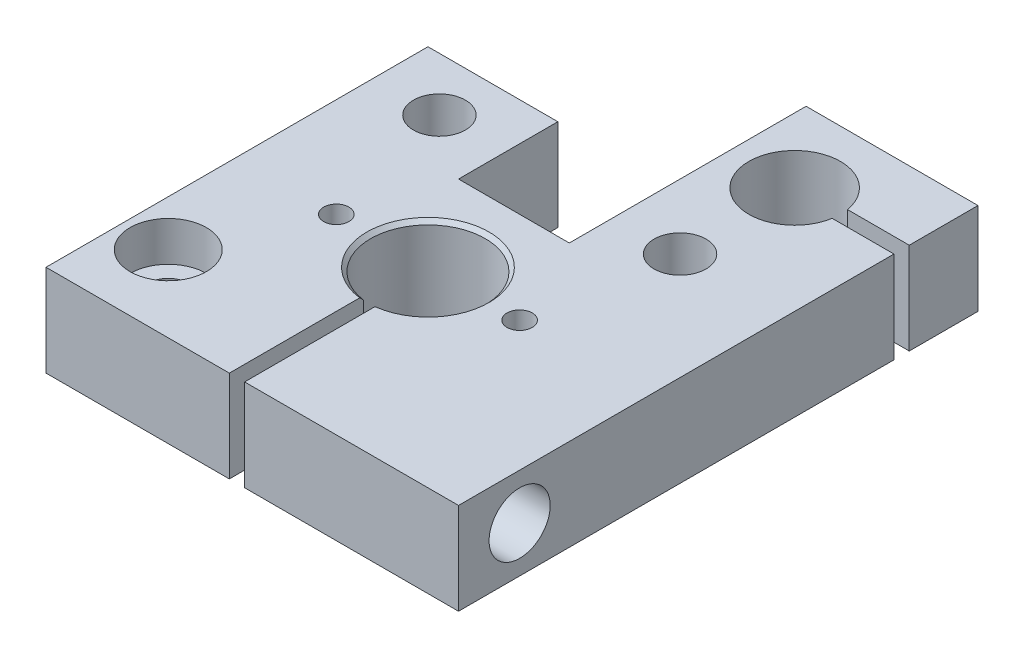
ISO-10303-21;
HEADER;
FILE_DESCRIPTION(('STEP AP214'),'2;1');
FILE_NAME('part.step','',(''),(''),'','','');
FILE_SCHEMA(('AUTOMOTIVE_DESIGN { 1 0 10303 214 1 1 1 1 }'));
ENDSEC;
DATA;
#1=APPLICATION_CONTEXT('core data for automotive mechanical design processes');
#2=APPLICATION_PROTOCOL_DEFINITION('international standard','automotive_design',2000,#1);
#3=PRODUCT_CONTEXT('',#1,'mechanical');
#4=PRODUCT('Part','Part','',(#3));
#5=PRODUCT_RELATED_PRODUCT_CATEGORY('part','',(#4));
#6=PRODUCT_DEFINITION_FORMATION('','',#4);
#7=PRODUCT_DEFINITION_CONTEXT('part definition',#1,'design');
#8=PRODUCT_DEFINITION('design','',#6,#7);
#9=PRODUCT_DEFINITION_SHAPE('','',#8);
#10=(LENGTH_UNIT() NAMED_UNIT(*) SI_UNIT(.MILLI.,.METRE.));
#11=(NAMED_UNIT(*) PLANE_ANGLE_UNIT() SI_UNIT($,.RADIAN.));
#12=(NAMED_UNIT(*) SI_UNIT($,.STERADIAN.) SOLID_ANGLE_UNIT());
#13=UNCERTAINTY_MEASURE_WITH_UNIT(LENGTH_MEASURE(1.E-05),#10,'distance_accuracy_value','');
#14=(GEOMETRIC_REPRESENTATION_CONTEXT(3) GLOBAL_UNCERTAINTY_ASSIGNED_CONTEXT((#13)) GLOBAL_UNIT_ASSIGNED_CONTEXT((#10,
#11,#12)) REPRESENTATION_CONTEXT('',''));
#15=CARTESIAN_POINT('',(0.,0.,0.));
#16=DIRECTION('',(0.,0.,1.));
#17=DIRECTION('',(1.,0.,0.));
#18=AXIS2_PLACEMENT_3D('',#15,#16,#17);
#19=CARTESIAN_POINT('',(54.,12.,0.));
#20=DIRECTION('',(-1.,0.,0.));
#21=DIRECTION('',(0.,0.,1.));
#22=AXIS2_PLACEMENT_3D('',#19,#20,#21);
#23=PLANE('',#22);
#24=DIRECTION('',(0.,0.,-1.));
#25=VECTOR('',#24,1.);
#26=CARTESIAN_POINT('',(54.,0.,0.));
#27=LINE('',#26,#25);
#28=CARTESIAN_POINT('',(54.,0.,0.));
#29=VERTEX_POINT('',#28);
#30=CARTESIAN_POINT('',(54.,0.,-57.));
#31=VERTEX_POINT('',#30);
#32=EDGE_CURVE('E9466',#29,#31,#27,.T.);
#33=ORIENTED_EDGE('',*,*,#32,.T.);
#34=DIRECTION('',(0.,-1.,0.));
#35=VECTOR('',#34,1.);
#36=CARTESIAN_POINT('',(54.,14.,-57.));
#37=LINE('',#36,#35);
#38=CARTESIAN_POINT('',(54.,12.,-57.));
#39=VERTEX_POINT('',#38);
#40=EDGE_CURVE('E9322',#39,#31,#37,.T.);
#41=ORIENTED_EDGE('',*,*,#40,.F.);
#42=DIRECTION('',(0.,0.,-1.));
#43=VECTOR('',#42,1.);
#44=CARTESIAN_POINT('',(54.,12.,0.));
#45=LINE('',#44,#43);
#46=CARTESIAN_POINT('',(54.,12.,0.));
#47=VERTEX_POINT('',#46);
#48=EDGE_CURVE('E9427',#47,#39,#45,.T.);
#49=ORIENTED_EDGE('',*,*,#48,.F.);
#50=DIRECTION('',(0.,-1.,0.));
#51=VECTOR('',#50,1.);
#52=CARTESIAN_POINT('',(54.,12.,0.));
#53=LINE('',#52,#51);
#54=EDGE_CURVE('E9438',#47,#29,#53,.T.);
#55=ORIENTED_EDGE('',*,*,#54,.T.);
#56=EDGE_LOOP('',(#33,#41,#49,#55));
#57=FACE_BOUND('',#56,.T.);
#58=CARTESIAN_POINT('',(54.,6.,-8.));
#59=DIRECTION('',(1.,0.,0.));
#60=DIRECTION('',(0.,0.,-1.));
#61=AXIS2_PLACEMENT_3D('',#58,#59,#60);
#62=CIRCLE('',#61,3.99999999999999);
#63=CARTESIAN_POINT('',(54.,6.,-12.));
#64=VERTEX_POINT('',#63);
#65=EDGE_CURVE('E9583',#64,#64,#62,.T.);
#66=ORIENTED_EDGE('',*,*,#65,.F.);
#67=EDGE_LOOP('',(#66));
#68=FACE_BOUND('',#67,.T.);
#69=ADVANCED_FACE('F9174',(#57,#68),#23,.F.);
#70=CARTESIAN_POINT('',(0.,12.,-68.));
#71=DIRECTION('',(0.,0.,1.));
#72=DIRECTION('',(1.,0.,0.));
#73=AXIS2_PLACEMENT_3D('',#70,#71,#72);
#74=PLANE('',#73);
#75=DIRECTION('',(-1.,0.,0.));
#76=VECTOR('',#75,1.);
#77=CARTESIAN_POINT('',(0.,0.,-68.));
#78=LINE('',#77,#76);
#79=CARTESIAN_POINT('',(54.,0.,-68.));
#80=VERTEX_POINT('',#79);
#81=CARTESIAN_POINT('',(31.5,0.,-68.));
#82=VERTEX_POINT('',#81);
#83=EDGE_CURVE('E9470',#80,#82,#78,.T.);
#84=ORIENTED_EDGE('',*,*,#83,.T.);
#85=DIRECTION('',(0.,1.,0.));
#86=VECTOR('',#85,1.);
#87=CARTESIAN_POINT('',(31.5,0.,-68.));
#88=LINE('',#87,#86);
#89=CARTESIAN_POINT('',(31.5,12.,-68.));
#90=VERTEX_POINT('',#89);
#91=EDGE_CURVE('E9459',#82,#90,#88,.T.);
#92=ORIENTED_EDGE('',*,*,#91,.T.);
#93=DIRECTION('',(-1.,0.,0.));
#94=VECTOR('',#93,1.);
#95=CARTESIAN_POINT('',(0.,12.,-68.));
#96=LINE('',#95,#94);
#97=CARTESIAN_POINT('',(54.,12.,-68.));
#98=VERTEX_POINT('',#97);
#99=EDGE_CURVE('E9431',#98,#90,#96,.T.);
#100=ORIENTED_EDGE('',*,*,#99,.F.);
#101=DIRECTION('',(0.,-1.,0.));
#102=VECTOR('',#101,1.);
#103=CARTESIAN_POINT('',(54.,12.,-68.));
#104=LINE('',#103,#102);
#105=EDGE_CURVE('E9423',#98,#80,#104,.T.);
#106=ORIENTED_EDGE('',*,*,#105,.T.);
#107=EDGE_LOOP('',(#84,#92,#100,#106));
#108=FACE_BOUND('',#107,.T.);
#109=CARTESIAN_POINT('',(49.5,6.,-68.));
#110=DIRECTION('',(0.,0.,-1.));
#111=DIRECTION('',(-1.,0.,0.));
#112=AXIS2_PLACEMENT_3D('',#109,#110,#111);
#113=CIRCLE('',#112,4.);
#114=CARTESIAN_POINT('',(45.5,6.,-68.));
#115=VERTEX_POINT('',#114);
#116=EDGE_CURVE('E9561',#115,#115,#113,.T.);
#117=ORIENTED_EDGE('',*,*,#116,.F.);
#118=EDGE_LOOP('',(#117));
#119=FACE_BOUND('',#118,.T.);
#120=ADVANCED_FACE('F9397',(#108,#119),#74,.F.);
#121=CARTESIAN_POINT('',(54.,12.,-59.));
#122=VERTEX_POINT('',#121);
#123=EDGE_CURVE('E9420',#122,#98,#45,.T.);
#124=ORIENTED_EDGE('',*,*,#123,.F.);
#125=DIRECTION('',(0.,1.,0.));
#126=VECTOR('',#125,1.);
#127=CARTESIAN_POINT('',(54.,14.,-59.));
#128=LINE('',#127,#126);
#129=CARTESIAN_POINT('',(54.,0.,-59.));
#130=VERTEX_POINT('',#129);
#131=EDGE_CURVE('E9326',#130,#122,#128,.T.);
#132=ORIENTED_EDGE('',*,*,#131,.F.);
#133=EDGE_CURVE('E9464',#130,#80,#27,.T.);
#134=ORIENTED_EDGE('',*,*,#133,.T.);
#135=ORIENTED_EDGE('',*,*,#105,.F.);
#136=EDGE_LOOP('',(#124,#132,#134,#135));
#137=FACE_BOUND('',#136,.T.);
#138=ADVANCED_FACE('F9400',(#137),#23,.F.);
#139=CARTESIAN_POINT('',(0.,12.,0.));
#140=DIRECTION('',(0.,0.,-1.));
#141=DIRECTION('',(-1.,0.,0.));
#142=AXIS2_PLACEMENT_3D('',#139,#140,#141);
#143=PLANE('',#142);
#144=DIRECTION('',(1.,0.,0.));
#145=VECTOR('',#144,1.);
#146=CARTESIAN_POINT('',(0.,12.,0.));
#147=LINE('',#146,#145);
#148=CARTESIAN_POINT('',(26.,12.,0.));
#149=VERTEX_POINT('',#148);
#150=EDGE_CURVE('E9433',#149,#47,#147,.T.);
#151=ORIENTED_EDGE('',*,*,#150,.F.);
#152=DIRECTION('',(0.,1.,0.));
#153=VECTOR('',#152,1.);
#154=CARTESIAN_POINT('',(26.,14.,0.));
#155=LINE('',#154,#153);
#156=CARTESIAN_POINT('',(26.,0.,0.));
#157=VERTEX_POINT('',#156);
#158=EDGE_CURVE('E9324',#157,#149,#155,.T.);
#159=ORIENTED_EDGE('',*,*,#158,.F.);
#160=DIRECTION('',(1.,0.,0.));
#161=VECTOR('',#160,1.);
#162=CARTESIAN_POINT('',(0.,0.,0.));
#163=LINE('',#162,#161);
#164=EDGE_CURVE('E9458',#157,#29,#163,.T.);
#165=ORIENTED_EDGE('',*,*,#164,.T.);
#166=ORIENTED_EDGE('',*,*,#54,.F.);
#167=EDGE_LOOP('',(#151,#159,#165,#166));
#168=FACE_BOUND('',#167,.T.);
#169=ADVANCED_FACE('F9410',(#168),#143,.F.);
#170=CARTESIAN_POINT('',(0.,0.,-68.));
#171=DIRECTION('',(0.,-1.,0.));
#172=DIRECTION('',(0.,0.,-1.));
#173=AXIS2_PLACEMENT_3D('',#170,#171,#172);
#174=PLANE('',#173);
#175=CARTESIAN_POINT('',(40.,0.,-58.));
#176=DIRECTION('',(0.,1.,0.));
#177=DIRECTION('',(0.,0.,1.));
#178=AXIS2_PLACEMENT_3D('',#175,#176,#177);
#179=CIRCLE('',#178,6.);
#180=CARTESIAN_POINT('',(45.9160797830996,0.,-59.));
#181=VERTEX_POINT('',#180);
#182=CARTESIAN_POINT('',(45.9160797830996,0.,-57.));
#183=VERTEX_POINT('',#182);
#184=EDGE_CURVE('E9303',#181,#183,#179,.T.);
#185=ORIENTED_EDGE('',*,*,#184,.T.);
#186=DIRECTION('',(-1.,0.,0.));
#187=VECTOR('',#186,1.);
#188=CARTESIAN_POINT('',(0.,0.,-57.));
#189=LINE('',#188,#187);
#190=EDGE_CURVE('E9314',#31,#183,#189,.T.);
#191=ORIENTED_EDGE('',*,*,#190,.F.);
#192=ORIENTED_EDGE('',*,*,#32,.F.);
#193=ORIENTED_EDGE('',*,*,#164,.F.);
#194=DIRECTION('',(0.,0.,1.));
#195=VECTOR('',#194,1.);
#196=CARTESIAN_POINT('',(26.,0.,-68.));
#197=LINE('',#196,#195);
#198=CARTESIAN_POINT('',(26.,0.,-17.0627460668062));
#199=VERTEX_POINT('',#198);
#200=EDGE_CURVE('E9481',#199,#157,#197,.T.);
#201=ORIENTED_EDGE('',*,*,#200,.F.);
#202=CARTESIAN_POINT('',(25.,0.,-25.));
#203=DIRECTION('',(0.,1.,0.));
#204=DIRECTION('',(0.,0.,1.));
#205=AXIS2_PLACEMENT_3D('',#202,#203,#204);
#206=CIRCLE('',#205,8.);
#207=CARTESIAN_POINT('',(24.,0.,-17.0627460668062));
#208=VERTEX_POINT('',#207);
#209=EDGE_CURVE('E9483',#199,#208,#206,.T.);
#210=ORIENTED_EDGE('',*,*,#209,.T.);
#211=DIRECTION('',(0.,0.,-1.));
#212=VECTOR('',#211,1.);
#213=CARTESIAN_POINT('',(24.,0.,-68.));
#214=LINE('',#213,#212);
#215=CARTESIAN_POINT('',(24.,0.,0.));
#216=VERTEX_POINT('',#215);
#217=EDGE_CURVE('E9463',#216,#208,#214,.T.);
#218=ORIENTED_EDGE('',*,*,#217,.F.);
#219=CARTESIAN_POINT('',(0.,0.,0.));
#220=VERTEX_POINT('',#219);
#221=EDGE_CURVE('E9449',#220,#216,#163,.T.);
#222=ORIENTED_EDGE('',*,*,#221,.F.);
#223=DIRECTION('',(0.,0.,1.));
#224=VECTOR('',#223,1.);
#225=CARTESIAN_POINT('',(0.,0.,0.));
#226=LINE('',#225,#224);
#227=CARTESIAN_POINT('',(0.,0.,-50.));
#228=VERTEX_POINT('',#227);
#229=EDGE_CURVE('E9455',#228,#220,#226,.T.);
#230=ORIENTED_EDGE('',*,*,#229,.F.);
#231=DIRECTION('',(1.,0.,0.));
#232=VECTOR('',#231,1.);
#233=CARTESIAN_POINT('',(17.,0.,-50.));
#234=LINE('',#233,#232);
#235=CARTESIAN_POINT('',(17.,0.,-50.));
#236=VERTEX_POINT('',#235);
#237=EDGE_CURVE('E9525',#228,#236,#234,.T.);
#238=ORIENTED_EDGE('',*,*,#237,.T.);
#239=DIRECTION('',(0.,0.,1.));
#240=VECTOR('',#239,1.);
#241=CARTESIAN_POINT('',(17.,0.,-37.));
#242=LINE('',#241,#240);
#243=CARTESIAN_POINT('',(17.,0.,-37.));
#244=VERTEX_POINT('',#243);
#245=EDGE_CURVE('E9527',#236,#244,#242,.T.);
#246=ORIENTED_EDGE('',*,*,#245,.T.);
#247=DIRECTION('',(1.,0.,0.));
#248=VECTOR('',#247,1.);
#249=CARTESIAN_POINT('',(31.5,0.,-37.));
#250=LINE('',#249,#248);
#251=CARTESIAN_POINT('',(31.5,0.,-37.));
#252=VERTEX_POINT('',#251);
#253=EDGE_CURVE('E9530',#244,#252,#250,.T.);
#254=ORIENTED_EDGE('',*,*,#253,.T.);
#255=DIRECTION('',(0.,0.,-1.));
#256=VECTOR('',#255,1.);
#257=CARTESIAN_POINT('',(31.5,0.,-68.));
#258=LINE('',#257,#256);
#259=EDGE_CURVE('E9533',#252,#82,#258,.T.);
#260=ORIENTED_EDGE('',*,*,#259,.T.);
#261=ORIENTED_EDGE('',*,*,#83,.F.);
#262=ORIENTED_EDGE('',*,*,#133,.F.);
#263=DIRECTION('',(1.,0.,0.));
#264=VECTOR('',#263,1.);
#265=CARTESIAN_POINT('',(0.,0.,-59.));
#266=LINE('',#265,#264);
#267=EDGE_CURVE('E9317',#181,#130,#266,.T.);
#268=ORIENTED_EDGE('',*,*,#267,.F.);
#269=EDGE_LOOP('',(#185,#191,#192,#193,#201,#210,#218,#222,#230,#238,#246,#254,#260,#261,#262,#268));
#270=FACE_BOUND('',#269,.T.);
#271=CARTESIAN_POINT('',(37.,0.,-25.));
#272=DIRECTION('',(0.,1.,0.));
#273=DIRECTION('',(0.,0.,1.));
#274=AXIS2_PLACEMENT_3D('',#271,#272,#273);
#275=CIRCLE('',#274,1.65);
#276=CARTESIAN_POINT('',(37.,0.,-23.35));
#277=VERTEX_POINT('',#276);
#278=EDGE_CURVE('E9849',#277,#277,#275,.T.);
#279=ORIENTED_EDGE('',*,*,#278,.T.);
#280=EDGE_LOOP('',(#279));
#281=FACE_BOUND('',#280,.T.);
#282=CARTESIAN_POINT('',(8.5,0.,-43.));
#283=DIRECTION('',(0.,1.,0.));
#284=DIRECTION('',(0.,0.,1.));
#285=AXIS2_PLACEMENT_3D('',#282,#283,#284);
#286=CIRCLE('',#285,3.4);
#287=CARTESIAN_POINT('',(8.5,0.,-39.6));
#288=VERTEX_POINT('',#287);
#289=EDGE_CURVE('E9508',#288,#288,#286,.T.);
#290=ORIENTED_EDGE('',*,*,#289,.T.);
#291=EDGE_LOOP('',(#290));
#292=FACE_BOUND('',#291,.T.);
#293=CARTESIAN_POINT('',(40.,0.,-43.));
#294=DIRECTION('',(0.,1.,0.));
#295=DIRECTION('',(0.,0.,1.));
#296=AXIS2_PLACEMENT_3D('',#293,#294,#295);
#297=CIRCLE('',#296,3.4);
#298=CARTESIAN_POINT('',(40.,0.,-39.6));
#299=VERTEX_POINT('',#298);
#300=EDGE_CURVE('E9502',#299,#299,#297,.T.);
#301=ORIENTED_EDGE('',*,*,#300,.T.);
#302=EDGE_LOOP('',(#301));
#303=FACE_BOUND('',#302,.T.);
#304=CARTESIAN_POINT('',(13.,0.,-25.));
#305=DIRECTION('',(0.,1.,0.));
#306=DIRECTION('',(0.,0.,1.));
#307=AXIS2_PLACEMENT_3D('',#304,#305,#306);
#308=CIRCLE('',#307,1.65);
#309=CARTESIAN_POINT('',(13.,0.,-23.35));
#310=VERTEX_POINT('',#309);
#311=EDGE_CURVE('E9493',#310,#310,#308,.T.);
#312=ORIENTED_EDGE('',*,*,#311,.T.);
#313=EDGE_LOOP('',(#312));
#314=FACE_BOUND('',#313,.T.);
#315=CARTESIAN_POINT('',(6.,0.,-10.));
#316=DIRECTION('',(0.,1.,0.));
#317=DIRECTION('',(0.,0.,1.));
#318=AXIS2_PLACEMENT_3D('',#315,#316,#317);
#319=CIRCLE('',#318,2.75);
#320=CARTESIAN_POINT('',(6.,0.,-7.25));
#321=VERTEX_POINT('',#320);
#322=EDGE_CURVE('E9484',#321,#321,#319,.T.);
#323=ORIENTED_EDGE('',*,*,#322,.T.);
#324=EDGE_LOOP('',(#323));
#325=FACE_BOUND('',#324,.T.);
#326=ADVANCED_FACE('F9311',(#270,#281,#292,#303,#314,#325),#174,.T.);
#327=CARTESIAN_POINT('',(0.,12.,0.));
#328=DIRECTION('',(1.,0.,0.));
#329=DIRECTION('',(0.,0.,-1.));
#330=AXIS2_PLACEMENT_3D('',#327,#328,#329);
#331=PLANE('',#330);
#332=DIRECTION('',(0.,0.,1.));
#333=VECTOR('',#332,1.);
#334=CARTESIAN_POINT('',(0.,12.,0.));
#335=LINE('',#334,#333);
#336=CARTESIAN_POINT('',(0.,12.,-50.));
#337=VERTEX_POINT('',#336);
#338=CARTESIAN_POINT('',(0.,12.,0.));
#339=VERTEX_POINT('',#338);
#340=EDGE_CURVE('E9453',#337,#339,#335,.T.);
#341=ORIENTED_EDGE('',*,*,#340,.F.);
#342=DIRECTION('',(0.,1.,0.));
#343=VECTOR('',#342,1.);
#344=CARTESIAN_POINT('',(0.,0.,-50.));
#345=LINE('',#344,#343);
#346=EDGE_CURVE('E9456',#228,#337,#345,.T.);
#347=ORIENTED_EDGE('',*,*,#346,.F.);
#348=ORIENTED_EDGE('',*,*,#229,.T.);
#349=DIRECTION('',(0.,-1.,0.));
#350=VECTOR('',#349,1.);
#351=CARTESIAN_POINT('',(0.,12.,0.));
#352=LINE('',#351,#350);
#353=EDGE_CURVE('E9373',#339,#220,#352,.T.);
#354=ORIENTED_EDGE('',*,*,#353,.F.);
#355=EDGE_LOOP('',(#341,#347,#348,#354));
#356=FACE_BOUND('',#355,.T.);
#357=ADVANCED_FACE('F9176',(#356),#331,.F.);
#358=ORIENTED_EDGE('',*,*,#221,.T.);
#359=DIRECTION('',(0.,-1.,0.));
#360=VECTOR('',#359,1.);
#361=CARTESIAN_POINT('',(24.,14.,0.));
#362=LINE('',#361,#360);
#363=CARTESIAN_POINT('',(24.,12.,0.));
#364=VERTEX_POINT('',#363);
#365=EDGE_CURVE('E9331',#364,#216,#362,.T.);
#366=ORIENTED_EDGE('',*,*,#365,.F.);
#367=EDGE_CURVE('E9428',#339,#364,#147,.T.);
#368=ORIENTED_EDGE('',*,*,#367,.F.);
#369=ORIENTED_EDGE('',*,*,#353,.T.);
#370=EDGE_LOOP('',(#358,#366,#368,#369));
#371=FACE_BOUND('',#370,.T.);
#372=ADVANCED_FACE('F9416',(#371),#143,.F.);
#373=CARTESIAN_POINT('',(0.,12.,-68.));
#374=DIRECTION('',(0.,-1.,0.));
#375=DIRECTION('',(0.,0.,-1.));
#376=AXIS2_PLACEMENT_3D('',#373,#374,#375);
#377=PLANE('',#376);
#378=CARTESIAN_POINT('',(6.,12.,-10.));
#379=DIRECTION('',(0.,1.,0.));
#380=DIRECTION('',(0.,0.,1.));
#381=AXIS2_PLACEMENT_3D('',#378,#379,#380);
#382=CIRCLE('',#381,4.99999999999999);
#383=CARTESIAN_POINT('',(6.,12.,-5.00000000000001));
#384=VERTEX_POINT('',#383);
#385=EDGE_CURVE('E9848',#384,#384,#382,.T.);
#386=ORIENTED_EDGE('',*,*,#385,.F.);
#387=EDGE_LOOP('',(#386));
#388=FACE_BOUND('',#387,.T.);
#389=CARTESIAN_POINT('',(37.,12.,-25.));
#390=DIRECTION('',(0.,1.,0.));
#391=DIRECTION('',(0.,0.,1.));
#392=AXIS2_PLACEMENT_3D('',#389,#390,#391);
#393=CIRCLE('',#392,1.64999999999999);
#394=CARTESIAN_POINT('',(37.,12.,-23.35));
#395=VERTEX_POINT('',#394);
#396=EDGE_CURVE('E9852',#395,#395,#393,.T.);
#397=ORIENTED_EDGE('',*,*,#396,.F.);
#398=EDGE_LOOP('',(#397));
#399=FACE_BOUND('',#398,.T.);
#400=CARTESIAN_POINT('',(13.,12.,-25.));
#401=DIRECTION('',(0.,1.,0.));
#402=DIRECTION('',(0.,0.,1.));
#403=AXIS2_PLACEMENT_3D('',#400,#401,#402);
#404=CIRCLE('',#403,1.65);
#405=CARTESIAN_POINT('',(13.,12.,-23.35));
#406=VERTEX_POINT('',#405);
#407=EDGE_CURVE('E9488',#406,#406,#404,.T.);
#408=ORIENTED_EDGE('',*,*,#407,.F.);
#409=EDGE_LOOP('',(#408));
#410=FACE_BOUND('',#409,.T.);
#411=CARTESIAN_POINT('',(40.,12.,-43.));
#412=DIRECTION('',(0.,1.,0.));
#413=DIRECTION('',(0.,0.,1.));
#414=AXIS2_PLACEMENT_3D('',#411,#412,#413);
#415=CIRCLE('',#414,3.39999999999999);
#416=CARTESIAN_POINT('',(40.,12.,-39.6));
#417=VERTEX_POINT('',#416);
#418=EDGE_CURVE('E9505',#417,#417,#415,.T.);
#419=ORIENTED_EDGE('',*,*,#418,.F.);
#420=EDGE_LOOP('',(#419));
#421=FACE_BOUND('',#420,.T.);
#422=CARTESIAN_POINT('',(8.5,12.,-43.));
#423=DIRECTION('',(0.,1.,0.));
#424=DIRECTION('',(0.,0.,1.));
#425=AXIS2_PLACEMENT_3D('',#422,#423,#424);
#426=CIRCLE('',#425,3.4);
#427=CARTESIAN_POINT('',(8.5,12.,-39.6));
#428=VERTEX_POINT('',#427);
#429=EDGE_CURVE('E9511',#428,#428,#426,.T.);
#430=ORIENTED_EDGE('',*,*,#429,.F.);
#431=EDGE_LOOP('',(#430));
#432=FACE_BOUND('',#431,.T.);
#433=DIRECTION('',(-1.,0.,0.));
#434=VECTOR('',#433,1.);
#435=CARTESIAN_POINT('',(0.,12.,-57.));
#436=LINE('',#435,#434);
#437=CARTESIAN_POINT('',(45.9160797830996,12.,-57.));
#438=VERTEX_POINT('',#437);
#439=EDGE_CURVE('E9909',#39,#438,#436,.T.);
#440=ORIENTED_EDGE('',*,*,#439,.T.);
#441=CARTESIAN_POINT('',(40.,12.,-58.));
#442=DIRECTION('',(0.,1.,0.));
#443=DIRECTION('',(0.,0.,1.));
#444=AXIS2_PLACEMENT_3D('',#441,#442,#443);
#445=CIRCLE('',#444,5.99999999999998);
#446=CARTESIAN_POINT('',(45.9160797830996,12.,-59.));
#447=VERTEX_POINT('',#446);
#448=EDGE_CURVE('E9189',#447,#438,#445,.T.);
#449=ORIENTED_EDGE('',*,*,#448,.F.);
#450=DIRECTION('',(1.,0.,0.));
#451=VECTOR('',#450,1.);
#452=CARTESIAN_POINT('',(0.,12.,-59.));
#453=LINE('',#452,#451);
#454=EDGE_CURVE('E9182',#447,#122,#453,.T.);
#455=ORIENTED_EDGE('',*,*,#454,.T.);
#456=ORIENTED_EDGE('',*,*,#123,.T.);
#457=ORIENTED_EDGE('',*,*,#99,.T.);
#458=DIRECTION('',(0.,0.,-1.));
#459=VECTOR('',#458,1.);
#460=CARTESIAN_POINT('',(31.5,12.,-68.));
#461=LINE('',#460,#459);
#462=CARTESIAN_POINT('',(31.5,12.,-37.));
#463=VERTEX_POINT('',#462);
#464=EDGE_CURVE('E9523',#463,#90,#461,.T.);
#465=ORIENTED_EDGE('',*,*,#464,.F.);
#466=DIRECTION('',(1.,0.,0.));
#467=VECTOR('',#466,1.);
#468=CARTESIAN_POINT('',(31.5,12.,-37.));
#469=LINE('',#468,#467);
#470=CARTESIAN_POINT('',(17.,12.,-37.));
#471=VERTEX_POINT('',#470);
#472=EDGE_CURVE('E9520',#471,#463,#469,.T.);
#473=ORIENTED_EDGE('',*,*,#472,.F.);
#474=DIRECTION('',(0.,0.,1.));
#475=VECTOR('',#474,1.);
#476=CARTESIAN_POINT('',(17.,12.,-37.));
#477=LINE('',#476,#475);
#478=CARTESIAN_POINT('',(17.,12.,-50.));
#479=VERTEX_POINT('',#478);
#480=EDGE_CURVE('E9517',#479,#471,#477,.T.);
#481=ORIENTED_EDGE('',*,*,#480,.F.);
#482=DIRECTION('',(1.,0.,0.));
#483=VECTOR('',#482,1.);
#484=CARTESIAN_POINT('',(17.,12.,-50.));
#485=LINE('',#484,#483);
#486=EDGE_CURVE('E9514',#337,#479,#485,.T.);
#487=ORIENTED_EDGE('',*,*,#486,.F.);
#488=ORIENTED_EDGE('',*,*,#340,.T.);
#489=ORIENTED_EDGE('',*,*,#367,.T.);
#490=DIRECTION('',(0.,0.,-1.));
#491=VECTOR('',#490,1.);
#492=CARTESIAN_POINT('',(24.,12.,-68.));
#493=LINE('',#492,#491);
#494=CARTESIAN_POINT('',(24.,12.,-17.0627460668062));
#495=VERTEX_POINT('',#494);
#496=EDGE_CURVE('E9344',#364,#495,#493,.T.);
#497=ORIENTED_EDGE('',*,*,#496,.T.);
#498=CARTESIAN_POINT('',(25.,12.,-25.));
#499=DIRECTION('',(0.,1.,0.));
#500=DIRECTION('',(0.,0.,1.));
#501=AXIS2_PLACEMENT_3D('',#498,#499,#500);
#502=CIRCLE('',#501,8.);
#503=CARTESIAN_POINT('',(26.,12.,-17.0627460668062));
#504=VERTEX_POINT('',#503);
#505=EDGE_CURVE('E9499',#504,#495,#502,.T.);
#506=ORIENTED_EDGE('',*,*,#505,.F.);
#507=DIRECTION('',(0.,0.,1.));
#508=VECTOR('',#507,1.);
#509=CARTESIAN_POINT('',(26.,12.,-68.));
#510=LINE('',#509,#508);
#511=EDGE_CURVE('E9477',#504,#149,#510,.T.);
#512=ORIENTED_EDGE('',*,*,#511,.T.);
#513=ORIENTED_EDGE('',*,*,#150,.T.);
#514=ORIENTED_EDGE('',*,*,#48,.T.);
#515=EDGE_LOOP('',(#440,#449,#455,#456,#457,#465,#473,#481,#487,#488,#489,#497,#506,#512,#513,#514));
#516=FACE_BOUND('',#515,.T.);
#517=ADVANCED_FACE('F9475',(#388,#399,#410,#421,#432,#516),#377,.F.);
#518=CARTESIAN_POINT('',(31.5,0.,-68.));
#519=DIRECTION('',(1.,0.,0.));
#520=DIRECTION('',(0.,0.,-1.));
#521=AXIS2_PLACEMENT_3D('',#518,#519,#520);
#522=PLANE('',#521);
#523=ORIENTED_EDGE('',*,*,#464,.T.);
#524=ORIENTED_EDGE('',*,*,#91,.F.);
#525=ORIENTED_EDGE('',*,*,#259,.F.);
#526=DIRECTION('',(0.,1.,0.));
#527=VECTOR('',#526,1.);
#528=CARTESIAN_POINT('',(31.5,0.,-37.));
#529=LINE('',#528,#527);
#530=EDGE_CURVE('E9538',#252,#463,#529,.T.);
#531=ORIENTED_EDGE('',*,*,#530,.T.);
#532=EDGE_LOOP('',(#523,#524,#525,#531));
#533=FACE_BOUND('',#532,.T.);
#534=ADVANCED_FACE('F9557',(#533),#522,.F.);
#535=CARTESIAN_POINT('',(31.5,0.,-37.));
#536=DIRECTION('',(0.,0.,1.));
#537=DIRECTION('',(1.,0.,0.));
#538=AXIS2_PLACEMENT_3D('',#535,#536,#537);
#539=PLANE('',#538);
#540=ORIENTED_EDGE('',*,*,#472,.T.);
#541=ORIENTED_EDGE('',*,*,#530,.F.);
#542=ORIENTED_EDGE('',*,*,#253,.F.);
#543=DIRECTION('',(0.,1.,0.));
#544=VECTOR('',#543,1.);
#545=CARTESIAN_POINT('',(17.,0.,-37.));
#546=LINE('',#545,#544);
#547=EDGE_CURVE('E9540',#244,#471,#546,.T.);
#548=ORIENTED_EDGE('',*,*,#547,.T.);
#549=EDGE_LOOP('',(#540,#541,#542,#548));
#550=FACE_BOUND('',#549,.T.);
#551=ADVANCED_FACE('F9555',(#550),#539,.F.);
#552=CARTESIAN_POINT('',(17.,0.,-37.));
#553=DIRECTION('',(-1.,0.,0.));
#554=DIRECTION('',(0.,0.,1.));
#555=AXIS2_PLACEMENT_3D('',#552,#553,#554);
#556=PLANE('',#555);
#557=ORIENTED_EDGE('',*,*,#480,.T.);
#558=ORIENTED_EDGE('',*,*,#547,.F.);
#559=ORIENTED_EDGE('',*,*,#245,.F.);
#560=DIRECTION('',(0.,1.,0.));
#561=VECTOR('',#560,1.);
#562=CARTESIAN_POINT('',(17.,0.,-50.));
#563=LINE('',#562,#561);
#564=EDGE_CURVE('E9542',#236,#479,#563,.T.);
#565=ORIENTED_EDGE('',*,*,#564,.T.);
#566=EDGE_LOOP('',(#557,#558,#559,#565));
#567=FACE_BOUND('',#566,.T.);
#568=ADVANCED_FACE('F9550',(#567),#556,.F.);
#569=CARTESIAN_POINT('',(17.,0.,-50.));
#570=DIRECTION('',(0.,0.,1.));
#571=DIRECTION('',(1.,0.,0.));
#572=AXIS2_PLACEMENT_3D('',#569,#570,#571);
#573=PLANE('',#572);
#574=ORIENTED_EDGE('',*,*,#486,.T.);
#575=ORIENTED_EDGE('',*,*,#564,.F.);
#576=ORIENTED_EDGE('',*,*,#237,.F.);
#577=ORIENTED_EDGE('',*,*,#346,.T.);
#578=EDGE_LOOP('',(#574,#575,#576,#577));
#579=FACE_BOUND('',#578,.T.);
#580=ADVANCED_FACE('F9544',(#579),#573,.F.);
#581=CARTESIAN_POINT('',(8.5,12.,-43.));
#582=DIRECTION('',(0.,1.,0.));
#583=DIRECTION('',(0.,0.,1.));
#584=AXIS2_PLACEMENT_3D('',#581,#582,#583);
#585=CYLINDRICAL_SURFACE('',#584,3.4);
#586=ORIENTED_EDGE('',*,*,#289,.F.);
#587=EDGE_LOOP('',(#586));
#588=FACE_BOUND('',#587,.T.);
#589=ORIENTED_EDGE('',*,*,#429,.T.);
#590=EDGE_LOOP('',(#589));
#591=FACE_BOUND('',#590,.T.);
#592=ADVANCED_FACE('F9769',(#588,#591),#585,.F.);
#593=CARTESIAN_POINT('',(40.,12.,-43.));
#594=DIRECTION('',(0.,1.,0.));
#595=DIRECTION('',(0.,0.,1.));
#596=AXIS2_PLACEMENT_3D('',#593,#594,#595);
#597=CYLINDRICAL_SURFACE('',#596,3.39999999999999);
#598=ORIENTED_EDGE('',*,*,#300,.F.);
#599=EDGE_LOOP('',(#598));
#600=FACE_BOUND('',#599,.T.);
#601=ORIENTED_EDGE('',*,*,#418,.T.);
#602=EDGE_LOOP('',(#601));
#603=FACE_BOUND('',#602,.T.);
#604=ADVANCED_FACE('F9393',(#600,#603),#597,.F.);
#605=CARTESIAN_POINT('',(25.,12.,-25.));
#606=DIRECTION('',(0.,1.,0.));
#607=DIRECTION('',(0.,0.,1.));
#608=AXIS2_PLACEMENT_3D('',#605,#606,#607);
#609=CONICAL_SURFACE('',#608,8.,0.785398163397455);
#610=CARTESIAN_POINT('',(25.,11.5,-25.));
#611=DIRECTION('',(0.,1.,0.));
#612=DIRECTION('',(0.,0.,1.));
#613=AXIS2_PLACEMENT_3D('',#610,#611,#612);
#614=CIRCLE('',#613,7.5);
#615=CARTESIAN_POINT('',(26.,11.5,-17.5669656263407));
#616=VERTEX_POINT('',#615);
#617=CARTESIAN_POINT('',(24.,11.5,-17.5669656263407));
#618=VERTEX_POINT('',#617);
#619=EDGE_CURVE('E9490',#616,#618,#614,.T.);
#620=ORIENTED_EDGE('',*,*,#619,.F.);
#621=CARTESIAN_POINT('',(26.,5.43966562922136,-23.9643180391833));
#622=CARTESIAN_POINT('',(26.,5.48094615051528,-23.9070109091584));
#623=CARTESIAN_POINT('',(26.,5.52323100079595,-23.850448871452));
#624=CARTESIAN_POINT('',(26.,5.60934117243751,-23.738533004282));
#625=CARTESIAN_POINT('',(26.,5.65316603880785,-23.6831788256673));
#626=CARTESIAN_POINT('',(26.,5.74187952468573,-23.5734046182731));
#627=CARTESIAN_POINT('',(26.,5.78676732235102,-23.5189839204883));
#628=CARTESIAN_POINT('',(26.,5.87738179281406,-23.4108387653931));
#629=CARTESIAN_POINT('',(26.,5.92310853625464,-23.3571143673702));
#630=CARTESIAN_POINT('',(26.,6.06115568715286,-23.1968565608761));
#631=CARTESIAN_POINT('',(26.,6.15442348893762,-23.0911405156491));
#632=CARTESIAN_POINT('',(26.,6.34255651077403,-22.8811021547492));
#633=CARTESIAN_POINT('',(26.,6.43742211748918,-22.7767801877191));
#634=CARTESIAN_POINT('',(26.,6.63130005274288,-22.565758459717));
#635=CARTESIAN_POINT('',(26.,6.7303473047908,-22.4590908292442));
#636=CARTESIAN_POINT('',(26.,6.92923167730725,-22.2464937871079));
#637=CARTESIAN_POINT('',(26.,7.02906880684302,-22.1405643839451));
#638=CARTESIAN_POINT('',(26.,7.32942927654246,-21.8235684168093));
#639=CARTESIAN_POINT('',(26.,7.5307953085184,-21.6133009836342));
#640=CARTESIAN_POINT('',(26.,7.93479238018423,-21.19399441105));
#641=CARTESIAN_POINT('',(26.,8.13742340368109,-20.9849552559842));
#642=CARTESIAN_POINT('',(26.,8.54348715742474,-20.5676659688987));
#643=CARTESIAN_POINT('',(26.,8.74691987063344,-20.3594158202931));
#644=CARTESIAN_POINT('',(26.,9.15461101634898,-19.9431456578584));
#645=CARTESIAN_POINT('',(26.,9.35887021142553,-19.7351263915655));
#646=CARTESIAN_POINT('',(26.,9.76776852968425,-19.3194595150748));
#647=CARTESIAN_POINT('',(26.,9.97240765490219,-19.1118119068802));
#648=CARTESIAN_POINT('',(26.,10.5867192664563,-18.4892830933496));
#649=CARTESIAN_POINT('',(26.,10.9967983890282,-18.0748032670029));
#650=CARTESIAN_POINT('',(26.,11.9166996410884,-17.1464082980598));
#651=CARTESIAN_POINT('',(26.,12.426688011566,-16.6326580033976));
#652=CARTESIAN_POINT('',(26.,13.4472112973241,-15.6056901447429));
#653=CARTESIAN_POINT('',(26.,13.9577462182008,-15.0924725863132));
#654=CARTESIAN_POINT('',(26.,14.9781260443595,-14.0674039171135));
#655=CARTESIAN_POINT('',(26.,15.4879702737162,-13.5555521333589));
#656=CARTESIAN_POINT('',(26.,16.5078849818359,-12.5320855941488));
#657=CARTESIAN_POINT('',(26.,17.0179554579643,-12.0204708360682));
#658=CARTESIAN_POINT('',(26.,17.5280903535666,-11.5089204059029));
#659=B_SPLINE_CURVE_WITH_KNOTS('',3,(#621,#622,#623,#624,#625,#626,#627,#628,#629,#630,#631,
#632,#633,#634,#635,#636,#637,#638,#639,#640,#641,#642,#643,#644,#645,#646,#647,#648,#649,#650,
#651,#652,#653,#654,#655,#656,#657,#658),.UNSPECIFIED.,.F.,.F.,(4,2,2,2,2,2,2,2,2,2,2,2,2,2,2,2,
2,2,4),(0.,0.21184514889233,0.423628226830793,0.635252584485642,0.846894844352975,
1.26979900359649,1.69280701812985,2.12948741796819,2.56617283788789,3.43957186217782,
4.31295972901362,5.18632913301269,6.06093960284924,6.93555477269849,8.68473200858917,
10.8564237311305,13.0281379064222,15.1954865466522,17.3628105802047),.UNSPECIFIED.);
#660=EDGE_CURVE('E9878',#616,#504,#659,.T.);
#661=ORIENTED_EDGE('',*,*,#660,.T.);
#662=ORIENTED_EDGE('',*,*,#505,.T.);
#663=CARTESIAN_POINT('',(24.,17.5280903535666,-11.5089204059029));
#664=CARTESIAN_POINT('',(24.,17.017383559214,-12.0210432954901));
#665=CARTESIAN_POINT('',(24.,16.5067421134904,-12.5332314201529));
#666=CARTESIAN_POINT('',(24.,15.4857208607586,-13.5578104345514));
#667=CARTESIAN_POINT('',(24.,14.9753410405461,-14.0702013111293));
#668=CARTESIAN_POINT('',(24.,13.9549956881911,-15.0952361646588));
#669=CARTESIAN_POINT('',(24.,13.4450301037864,-15.6078800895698));
#670=CARTESIAN_POINT('',(24.,12.6804787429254,-16.3772671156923));
#671=CARTESIAN_POINT('',(24.,12.4256878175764,-16.6338063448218));
#672=CARTESIAN_POINT('',(24.,11.9162856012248,-17.1470662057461));
#673=CARTESIAN_POINT('',(24.,11.6616743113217,-17.4037868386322));
#674=CARTESIAN_POINT('',(24.,11.1526131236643,-17.917551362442));
#675=CARTESIAN_POINT('',(24.,10.8981633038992,-18.1745953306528));
#676=CARTESIAN_POINT('',(24.,10.3896066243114,-18.6890113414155));
#677=CARTESIAN_POINT('',(24.,10.1354997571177,-18.9463833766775));
#678=CARTESIAN_POINT('',(24.,9.62781785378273,-19.4615658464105));
#679=CARTESIAN_POINT('',(24.,9.37424273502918,-19.7193761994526));
#680=CARTESIAN_POINT('',(24.,8.86781054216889,-20.235741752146));
#681=CARTESIAN_POINT('',(24.,8.61495352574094,-20.4942970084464));
#682=CARTESIAN_POINT('',(24.,8.2365091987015,-20.8830985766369));
#683=CARTESIAN_POINT('',(24.,8.11046408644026,-21.0128991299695));
#684=CARTESIAN_POINT('',(24.,7.85878744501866,-21.2728951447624));
#685=CARTESIAN_POINT('',(24.,7.73315590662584,-21.4030905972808));
#686=CARTESIAN_POINT('',(24.,7.48248297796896,-21.6639847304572));
#687=CARTESIAN_POINT('',(24.,7.35744144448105,-21.7946832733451));
#688=CARTESIAN_POINT('',(24.,7.10813858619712,-22.0568433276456));
#689=CARTESIAN_POINT('',(24.,6.9838773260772,-22.1883049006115));
#690=CARTESIAN_POINT('',(24.,6.73640255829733,-22.4524412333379));
#691=CARTESIAN_POINT('',(24.,6.61319011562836,-22.5851169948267));
#692=CARTESIAN_POINT('',(24.,6.42977436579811,-22.7853870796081));
#693=CARTESIAN_POINT('',(24.,6.36887679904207,-22.8523451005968));
#694=CARTESIAN_POINT('',(24.,6.2476837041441,-22.9868099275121));
#695=CARTESIAN_POINT('',(24.,6.18738820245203,-23.0543167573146));
#696=CARTESIAN_POINT('',(24.,6.0675327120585,-23.1901071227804));
#697=CARTESIAN_POINT('',(24.,6.00797355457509,-23.2583913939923));
#698=CARTESIAN_POINT('',(24.,5.88995320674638,-23.3958899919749));
#699=CARTESIAN_POINT('',(24.,5.83149188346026,-23.4651042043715));
#700=CARTESIAN_POINT('',(24.,5.7160544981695,-23.6048641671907));
#701=CARTESIAN_POINT('',(24.,5.65907967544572,-23.6754109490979));
#702=CARTESIAN_POINT('',(24.,5.57531303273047,-23.7825824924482));
#703=CARTESIAN_POINT('',(24.,5.54766789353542,-23.8185391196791));
#704=CARTESIAN_POINT('',(24.,5.49309242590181,-23.8909973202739));
#705=CARTESIAN_POINT('',(24.,5.46616218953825,-23.9274989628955));
#706=CARTESIAN_POINT('',(24.,5.43966562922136,-23.9643180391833));
#707=B_SPLINE_CURVE_WITH_KNOTS('',3,(#663,#664,#665,#666,#667,#668,#669,#670,#671,#672,#673,
#674,#675,#676,#677,#678,#679,#680,#681,#682,#683,#684,#685,#686,#687,#688,#689,#690,#691,#692,
#693,#694,#695,#696,#697,#698,#699,#700,#701,#702,#703,#704,#705,#706),.UNSPECIFIED.,.F.,.F.,(4,
2,2,2,2,2,2,2,2,2,2,2,2,2,2,2,2,2,2,2,2,4),(0.,2.169751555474,4.33937996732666,6.50866945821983,
7.59337079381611,8.67807871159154,9.76313464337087,10.8481668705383,11.9330157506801,
13.0179494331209,13.5607378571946,14.1035140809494,14.6461509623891,15.1888322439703,
15.7320110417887,16.0035355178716,16.2750718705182,16.5468909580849,16.8186769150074,
17.0906826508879,17.2267416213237,17.3628180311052),.UNSPECIFIED.);
#708=EDGE_CURVE('E9336',#495,#618,#707,.T.);
#709=ORIENTED_EDGE('',*,*,#708,.T.);
#710=EDGE_LOOP('',(#620,#661,#662,#709));
#711=FACE_BOUND('',#710,.T.);
#712=ADVANCED_FACE('F9346',(#711),#609,.F.);
#713=CARTESIAN_POINT('',(25.,12.,-25.));
#714=DIRECTION('',(0.,1.,0.));
#715=DIRECTION('',(0.,0.,1.));
#716=AXIS2_PLACEMENT_3D('',#713,#714,#715);
#717=CYLINDRICAL_SURFACE('',#716,7.5);
#718=CARTESIAN_POINT('',(25.,0.499999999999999,-25.));
#719=DIRECTION('',(0.,1.,0.));
#720=DIRECTION('',(0.,0.,1.));
#721=AXIS2_PLACEMENT_3D('',#718,#719,#720);
#722=CIRCLE('',#721,7.5);
#723=CARTESIAN_POINT('',(26.,0.499999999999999,-17.5669656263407));
#724=VERTEX_POINT('',#723);
#725=CARTESIAN_POINT('',(24.,0.499999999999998,-17.5669656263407));
#726=VERTEX_POINT('',#725);
#727=EDGE_CURVE('E9487',#724,#726,#722,.T.);
#728=ORIENTED_EDGE('',*,*,#727,.F.);
#729=DIRECTION('',(0.,1.,0.));
#730=VECTOR('',#729,1.);
#731=CARTESIAN_POINT('',(26.,12.,-17.5669656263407));
#732=LINE('',#731,#730);
#733=EDGE_CURVE('E9196',#724,#616,#732,.T.);
#734=ORIENTED_EDGE('',*,*,#733,.T.);
#735=ORIENTED_EDGE('',*,*,#619,.T.);
#736=DIRECTION('',(0.,1.,0.));
#737=VECTOR('',#736,1.);
#738=CARTESIAN_POINT('',(24.,12.,-17.5669656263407));
#739=LINE('',#738,#737);
#740=EDGE_CURVE('E9333',#618,#726,#739,.F.);
#741=ORIENTED_EDGE('',*,*,#740,.T.);
#742=EDGE_LOOP('',(#728,#734,#735,#741));
#743=FACE_BOUND('',#742,.T.);
#744=ADVANCED_FACE('F9384',(#743),#717,.F.);
#745=CARTESIAN_POINT('',(25.,0.499999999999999,-25.));
#746=DIRECTION('',(0.,-1.,0.));
#747=DIRECTION('',(0.,0.,-1.));
#748=AXIS2_PLACEMENT_3D('',#745,#746,#747);
#749=CONICAL_SURFACE('',#748,7.5,0.785398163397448);
#750=ORIENTED_EDGE('',*,*,#209,.F.);
#751=CARTESIAN_POINT('',(26.,-5.52809035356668,-11.5089204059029));
#752=CARTESIAN_POINT('',(26.,-5.0173835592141,-12.0210432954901));
#753=CARTESIAN_POINT('',(26.,-4.50674211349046,-12.533231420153));
#754=CARTESIAN_POINT('',(26.,-3.48572086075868,-13.5578104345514));
#755=CARTESIAN_POINT('',(26.,-2.97534104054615,-14.0702013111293));
#756=CARTESIAN_POINT('',(26.,-1.95499568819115,-15.0952361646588));
#757=CARTESIAN_POINT('',(26.,-1.44503010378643,-15.6078800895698));
#758=CARTESIAN_POINT('',(26.,-0.680478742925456,-16.3772671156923));
#759=CARTESIAN_POINT('',(26.,-0.425687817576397,-16.6338063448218));
#760=CARTESIAN_POINT('',(26.,0.0837143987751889,-17.1470662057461));
#761=CARTESIAN_POINT('',(26.,0.338325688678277,-17.4037868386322));
#762=CARTESIAN_POINT('',(26.,0.847386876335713,-17.917551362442));
#763=CARTESIAN_POINT('',(26.,1.10183669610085,-18.1745953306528));
#764=CARTESIAN_POINT('',(26.,1.61039337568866,-18.6890113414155));
#765=CARTESIAN_POINT('',(26.,1.86450024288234,-18.9463833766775));
#766=CARTESIAN_POINT('',(26.,2.3721821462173,-19.4615658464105));
#767=CARTESIAN_POINT('',(26.,2.62575726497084,-19.7193761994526));
#768=CARTESIAN_POINT('',(26.,3.13218945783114,-20.235741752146));
#769=CARTESIAN_POINT('',(26.,3.38504647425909,-20.4942970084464));
#770=CARTESIAN_POINT('',(26.,3.76349080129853,-20.8830985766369));
#771=CARTESIAN_POINT('',(26.,3.88953591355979,-21.0128991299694));
#772=CARTESIAN_POINT('',(26.,4.14121255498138,-21.2728951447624));
#773=CARTESIAN_POINT('',(26.,4.26684409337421,-21.4030905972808));
#774=CARTESIAN_POINT('',(26.,4.51751702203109,-21.6639847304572));
#775=CARTESIAN_POINT('',(26.,4.642558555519,-21.7946832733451));
#776=CARTESIAN_POINT('',(26.,4.89186141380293,-22.0568433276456));
#777=CARTESIAN_POINT('',(26.,5.01612267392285,-22.1883049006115));
#778=CARTESIAN_POINT('',(26.,5.26359744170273,-22.4524412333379));
#779=CARTESIAN_POINT('',(26.,5.3868098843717,-22.5851169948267));
#780=CARTESIAN_POINT('',(26.,5.57022563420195,-22.785387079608));
#781=CARTESIAN_POINT('',(26.,5.63112320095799,-22.8523451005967));
#782=CARTESIAN_POINT('',(26.,5.75231629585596,-22.986809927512));
#783=CARTESIAN_POINT('',(26.,5.81261179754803,-23.0543167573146));
#784=CARTESIAN_POINT('',(26.,5.93246728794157,-23.1901071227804));
#785=CARTESIAN_POINT('',(26.,5.99202644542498,-23.2583913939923));
#786=CARTESIAN_POINT('',(26.,6.11004679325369,-23.3958899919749));
#787=CARTESIAN_POINT('',(26.,6.16850811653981,-23.4651042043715));
#788=CARTESIAN_POINT('',(26.,6.28394550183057,-23.6048641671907));
#789=CARTESIAN_POINT('',(26.,6.34092032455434,-23.6754109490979));
#790=CARTESIAN_POINT('',(26.,6.42468696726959,-23.7825824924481));
#791=CARTESIAN_POINT('',(26.,6.45233210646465,-23.8185391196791));
#792=CARTESIAN_POINT('',(26.,6.50690757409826,-23.8909973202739));
#793=CARTESIAN_POINT('',(26.,6.53383781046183,-23.9274989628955));
#794=CARTESIAN_POINT('',(26.,6.56033437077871,-23.9643180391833));
#795=B_SPLINE_CURVE_WITH_KNOTS('',3,(#751,#752,#753,#754,#755,#756,#757,#758,#759,#760,#761,
#762,#763,#764,#765,#766,#767,#768,#769,#770,#771,#772,#773,#774,#775,#776,#777,#778,#779,#780,
#781,#782,#783,#784,#785,#786,#787,#788,#789,#790,#791,#792,#793,#794),.UNSPECIFIED.,.F.,.F.,(4,
2,2,2,2,2,2,2,2,2,2,2,2,2,2,2,2,2,2,2,2,4),(0.,2.16975155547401,4.33937996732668,
6.50866945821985,7.59337079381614,8.67807871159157,9.7631346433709,10.8481668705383,
11.9330157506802,13.0179494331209,13.5607378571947,14.1035140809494,14.6461509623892,
15.1888322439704,15.7320110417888,16.0035355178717,16.2750718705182,16.5468909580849,
16.8186769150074,17.090682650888,17.2267416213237,17.3628180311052),.UNSPECIFIED.);
#796=EDGE_CURVE('E9372',#199,#724,#795,.T.);
#797=ORIENTED_EDGE('',*,*,#796,.T.);
#798=ORIENTED_EDGE('',*,*,#727,.T.);
#799=CARTESIAN_POINT('',(24.,6.56033437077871,-23.9643180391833));
#800=CARTESIAN_POINT('',(24.,6.51905384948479,-23.9070109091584));
#801=CARTESIAN_POINT('',(24.,6.47676899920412,-23.850448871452));
#802=CARTESIAN_POINT('',(24.,6.39065882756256,-23.738533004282));
#803=CARTESIAN_POINT('',(24.,6.34683396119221,-23.6831788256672));
#804=CARTESIAN_POINT('',(24.,6.25812047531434,-23.5734046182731));
#805=CARTESIAN_POINT('',(24.,6.21323267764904,-23.5189839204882));
#806=CARTESIAN_POINT('',(24.,6.12261820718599,-23.4108387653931));
#807=CARTESIAN_POINT('',(24.,6.07689146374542,-23.3571143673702));
#808=CARTESIAN_POINT('',(24.,5.93884431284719,-23.1968565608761));
#809=CARTESIAN_POINT('',(24.,5.84557651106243,-23.091140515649));
#810=CARTESIAN_POINT('',(24.,5.65744348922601,-22.8811021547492));
#811=CARTESIAN_POINT('',(24.,5.56257788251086,-22.776780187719));
#812=CARTESIAN_POINT('',(24.,5.36869994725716,-22.565758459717));
#813=CARTESIAN_POINT('',(24.,5.26965269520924,-22.4590908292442));
#814=CARTESIAN_POINT('',(24.,5.07076832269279,-22.2464937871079));
#815=CARTESIAN_POINT('',(24.,4.97093119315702,-22.1405643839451));
#816=CARTESIAN_POINT('',(24.,4.67057072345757,-21.8235684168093));
#817=CARTESIAN_POINT('',(24.,4.46920469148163,-21.6133009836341));
#818=CARTESIAN_POINT('',(24.,4.0652076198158,-21.19399441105));
#819=CARTESIAN_POINT('',(24.,3.86257659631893,-20.9849552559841));
#820=CARTESIAN_POINT('',(24.,3.45651284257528,-20.5676659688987));
#821=CARTESIAN_POINT('',(24.,3.25308012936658,-20.3594158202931));
#822=CARTESIAN_POINT('',(24.,2.84538898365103,-19.9431456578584));
#823=CARTESIAN_POINT('',(24.,2.64112978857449,-19.7351263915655));
#824=CARTESIAN_POINT('',(24.,2.23223147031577,-19.3194595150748));
#825=CARTESIAN_POINT('',(24.,2.02759234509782,-19.1118119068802));
#826=CARTESIAN_POINT('',(24.,1.41328073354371,-18.4892830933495));
#827=CARTESIAN_POINT('',(24.,1.00320161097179,-18.0748032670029));
#828=CARTESIAN_POINT('',(24.,0.0833003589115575,-17.1464082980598));
#829=CARTESIAN_POINT('',(24.,-0.426688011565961,-16.6326580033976));
#830=CARTESIAN_POINT('',(24.,-1.44721129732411,-15.6056901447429));
#831=CARTESIAN_POINT('',(24.,-1.95774621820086,-15.0924725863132));
#832=CARTESIAN_POINT('',(24.,-2.97812604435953,-14.0674039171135));
#833=CARTESIAN_POINT('',(24.,-3.48797027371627,-13.5555521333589));
#834=CARTESIAN_POINT('',(24.,-4.5078849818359,-12.5320855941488));
#835=CARTESIAN_POINT('',(24.,-5.01795545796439,-12.0204708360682));
#836=CARTESIAN_POINT('',(24.,-5.52809035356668,-11.5089204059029));
#837=B_SPLINE_CURVE_WITH_KNOTS('',3,(#799,#800,#801,#802,#803,#804,#805,#806,#807,#808,#809,
#810,#811,#812,#813,#814,#815,#816,#817,#818,#819,#820,#821,#822,#823,#824,#825,#826,#827,#828,
#829,#830,#831,#832,#833,#834,#835,#836),.UNSPECIFIED.,.F.,.F.,(4,2,2,2,2,2,2,2,2,2,2,2,2,2,2,2,
2,2,4),(0.,0.211845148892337,0.423628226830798,0.635252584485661,0.846894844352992,
1.26979900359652,1.69280701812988,2.12948741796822,2.56617283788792,3.43957186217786,
4.31295972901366,5.18632913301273,6.06093960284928,6.93555477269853,8.6847320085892,
10.8564237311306,13.0281379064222,15.1954865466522,17.3628105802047),.UNSPECIFIED.);
#838=EDGE_CURVE('E9364',#726,#208,#837,.T.);
#839=ORIENTED_EDGE('',*,*,#838,.T.);
#840=EDGE_LOOP('',(#750,#797,#798,#839));
#841=FACE_BOUND('',#840,.T.);
#842=ADVANCED_FACE('F9379',(#841),#749,.F.);
#843=CARTESIAN_POINT('',(13.,12.,-25.));
#844=DIRECTION('',(0.,1.,0.));
#845=DIRECTION('',(0.,0.,1.));
#846=AXIS2_PLACEMENT_3D('',#843,#844,#845);
#847=CYLINDRICAL_SURFACE('',#846,1.65);
#848=ORIENTED_EDGE('',*,*,#311,.F.);
#849=EDGE_LOOP('',(#848));
#850=FACE_BOUND('',#849,.T.);
#851=ORIENTED_EDGE('',*,*,#407,.T.);
#852=EDGE_LOOP('',(#851));
#853=FACE_BOUND('',#852,.T.);
#854=ADVANCED_FACE('F9383',(#850,#853),#847,.F.);
#855=CARTESIAN_POINT('',(37.,12.,-25.));
#856=DIRECTION('',(0.,1.,0.));
#857=DIRECTION('',(0.,0.,1.));
#858=AXIS2_PLACEMENT_3D('',#855,#856,#857);
#859=CYLINDRICAL_SURFACE('',#858,1.65);
#860=ORIENTED_EDGE('',*,*,#278,.F.);
#861=EDGE_LOOP('',(#860));
#862=FACE_BOUND('',#861,.T.);
#863=ORIENTED_EDGE('',*,*,#396,.T.);
#864=EDGE_LOOP('',(#863));
#865=FACE_BOUND('',#864,.T.);
#866=ADVANCED_FACE('F9749',(#862,#865),#859,.F.);
#867=CARTESIAN_POINT('',(6.,12.,-10.));
#868=DIRECTION('',(0.,1.,0.));
#869=DIRECTION('',(0.,0.,1.));
#870=AXIS2_PLACEMENT_3D('',#867,#868,#869);
#871=CYLINDRICAL_SURFACE('',#870,4.99999999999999);
#872=CARTESIAN_POINT('',(6.,6.8,-10.));
#873=DIRECTION('',(0.,1.,0.));
#874=DIRECTION('',(0.,0.,1.));
#875=AXIS2_PLACEMENT_3D('',#872,#873,#874);
#876=CIRCLE('',#875,5.);
#877=CARTESIAN_POINT('',(6.,6.8,-5.));
#878=VERTEX_POINT('',#877);
#879=EDGE_CURVE('E9845',#878,#878,#876,.T.);
#880=ORIENTED_EDGE('',*,*,#879,.F.);
#881=EDGE_LOOP('',(#880));
#882=FACE_BOUND('',#881,.T.);
#883=ORIENTED_EDGE('',*,*,#385,.T.);
#884=EDGE_LOOP('',(#883));
#885=FACE_BOUND('',#884,.T.);
#886=ADVANCED_FACE('F9753',(#882,#885),#871,.F.);
#887=CARTESIAN_POINT('',(8.75,6.8,-10.));
#888=DIRECTION('',(0.,-1.,0.));
#889=DIRECTION('',(0.,0.,-1.));
#890=AXIS2_PLACEMENT_3D('',#887,#888,#889);
#891=PLANE('',#890);
#892=CARTESIAN_POINT('',(6.,6.8,-10.));
#893=DIRECTION('',(0.,1.,0.));
#894=DIRECTION('',(0.,0.,1.));
#895=AXIS2_PLACEMENT_3D('',#892,#893,#894);
#896=CIRCLE('',#895,2.75);
#897=CARTESIAN_POINT('',(6.,6.8,-7.25));
#898=VERTEX_POINT('',#897);
#899=EDGE_CURVE('E9854',#898,#898,#896,.T.);
#900=ORIENTED_EDGE('',*,*,#899,.F.);
#901=EDGE_LOOP('',(#900));
#902=FACE_BOUND('',#901,.T.);
#903=ORIENTED_EDGE('',*,*,#879,.T.);
#904=EDGE_LOOP('',(#903));
#905=FACE_BOUND('',#904,.T.);
#906=ADVANCED_FACE('F9827',(#902,#905),#891,.F.);
#907=CARTESIAN_POINT('',(6.,12.,-10.));
#908=DIRECTION('',(0.,1.,0.));
#909=DIRECTION('',(0.,0.,1.));
#910=AXIS2_PLACEMENT_3D('',#907,#908,#909);
#911=CYLINDRICAL_SURFACE('',#910,2.75);
#912=ORIENTED_EDGE('',*,*,#322,.F.);
#913=EDGE_LOOP('',(#912));
#914=FACE_BOUND('',#913,.T.);
#915=ORIENTED_EDGE('',*,*,#899,.T.);
#916=EDGE_LOOP('',(#915));
#917=FACE_BOUND('',#916,.T.);
#918=ADVANCED_FACE('F9356',(#914,#917),#911,.F.);
#919=CARTESIAN_POINT('',(24.,14.,-25.));
#920=DIRECTION('',(-1.,0.,0.));
#921=DIRECTION('',(0.,0.,1.));
#922=AXIS2_PLACEMENT_3D('',#919,#920,#921);
#923=PLANE('',#922);
#924=CARTESIAN_POINT('',(24.,6.,-8.));
#925=DIRECTION('',(1.,0.,0.));
#926=DIRECTION('',(0.,0.,-1.));
#927=AXIS2_PLACEMENT_3D('',#924,#925,#926);
#928=CIRCLE('',#927,1.64999999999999);
#929=CARTESIAN_POINT('',(24.,6.,-9.64999999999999));
#930=VERTEX_POINT('',#929);
#931=EDGE_CURVE('E9577',#930,#930,#928,.T.);
#932=ORIENTED_EDGE('',*,*,#931,.F.);
#933=EDGE_LOOP('',(#932));
#934=FACE_BOUND('',#933,.T.);
#935=ORIENTED_EDGE('',*,*,#217,.T.);
#936=ORIENTED_EDGE('',*,*,#838,.F.);
#937=ORIENTED_EDGE('',*,*,#740,.F.);
#938=ORIENTED_EDGE('',*,*,#708,.F.);
#939=ORIENTED_EDGE('',*,*,#496,.F.);
#940=ORIENTED_EDGE('',*,*,#365,.T.);
#941=EDGE_LOOP('',(#935,#936,#937,#938,#939,#940));
#942=FACE_BOUND('',#941,.T.);
#943=ADVANCED_FACE('F9350',(#934,#942),#923,.F.);
#944=CARTESIAN_POINT('',(26.,14.,-25.));
#945=DIRECTION('',(1.,0.,0.));
#946=DIRECTION('',(0.,1.,0.));
#947=AXIS2_PLACEMENT_3D('',#944,#945,#946);
#948=PLANE('',#947);
#949=CARTESIAN_POINT('',(26.,6.,-8.));
#950=DIRECTION('',(1.,0.,0.));
#951=DIRECTION('',(0.,1.,0.));
#952=AXIS2_PLACEMENT_3D('',#949,#950,#951);
#953=CIRCLE('',#952,2.25);
#954=CARTESIAN_POINT('',(26.,8.25,-8.));
#955=VERTEX_POINT('',#954);
#956=EDGE_CURVE('E9592',#955,#955,#953,.T.);
#957=ORIENTED_EDGE('',*,*,#956,.T.);
#958=EDGE_LOOP('',(#957));
#959=FACE_BOUND('',#958,.T.);
#960=ORIENTED_EDGE('',*,*,#200,.T.);
#961=ORIENTED_EDGE('',*,*,#158,.T.);
#962=ORIENTED_EDGE('',*,*,#511,.F.);
#963=ORIENTED_EDGE('',*,*,#660,.F.);
#964=ORIENTED_EDGE('',*,*,#733,.F.);
#965=ORIENTED_EDGE('',*,*,#796,.F.);
#966=EDGE_LOOP('',(#960,#961,#962,#963,#964,#965));
#967=FACE_BOUND('',#966,.T.);
#968=ADVANCED_FACE('F9355',(#959,#967),#948,.F.);
#969=CARTESIAN_POINT('',(40.,14.,-59.));
#970=DIRECTION('',(0.,0.,-1.));
#971=DIRECTION('',(-1.,0.,0.));
#972=AXIS2_PLACEMENT_3D('',#969,#970,#971);
#973=PLANE('',#972);
#974=CARTESIAN_POINT('',(49.5,6.,-59.));
#975=DIRECTION('',(0.,0.,-1.));
#976=DIRECTION('',(-1.,0.,0.));
#977=AXIS2_PLACEMENT_3D('',#974,#975,#976);
#978=CIRCLE('',#977,2.25);
#979=CARTESIAN_POINT('',(47.25,6.,-59.));
#980=VERTEX_POINT('',#979);
#981=EDGE_CURVE('E9563',#980,#980,#978,.T.);
#982=ORIENTED_EDGE('',*,*,#981,.T.);
#983=EDGE_LOOP('',(#982));
#984=FACE_BOUND('',#983,.T.);
#985=ORIENTED_EDGE('',*,*,#454,.F.);
#986=DIRECTION('',(0.,1.,0.));
#987=VECTOR('',#986,1.);
#988=CARTESIAN_POINT('',(45.9160797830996,12.,-59.));
#989=LINE('',#988,#987);
#990=EDGE_CURVE('E9318',#447,#181,#989,.F.);
#991=ORIENTED_EDGE('',*,*,#990,.T.);
#992=ORIENTED_EDGE('',*,*,#267,.T.);
#993=ORIENTED_EDGE('',*,*,#131,.T.);
#994=EDGE_LOOP('',(#985,#991,#992,#993));
#995=FACE_BOUND('',#994,.T.);
#996=ADVANCED_FACE('F9358',(#984,#995),#973,.F.);
#997=CARTESIAN_POINT('',(40.,14.,-57.));
#998=DIRECTION('',(0.,0.,1.));
#999=DIRECTION('',(1.,0.,0.));
#1000=AXIS2_PLACEMENT_3D('',#997,#998,#999);
#1001=PLANE('',#1000);
#1002=CARTESIAN_POINT('',(49.5,6.,-57.));
#1003=DIRECTION('',(0.,0.,-1.));
#1004=DIRECTION('',(-1.,0.,0.));
#1005=AXIS2_PLACEMENT_3D('',#1002,#1003,#1004);
#1006=CIRCLE('',#1005,1.65);
#1007=CARTESIAN_POINT('',(47.85,6.,-57.));
#1008=VERTEX_POINT('',#1007);
#1009=EDGE_CURVE('E9598',#1008,#1008,#1006,.T.);
#1010=ORIENTED_EDGE('',*,*,#1009,.F.);
#1011=EDGE_LOOP('',(#1010));
#1012=FACE_BOUND('',#1011,.T.);
#1013=ORIENTED_EDGE('',*,*,#190,.T.);
#1014=DIRECTION('',(0.,1.,0.));
#1015=VECTOR('',#1014,1.);
#1016=CARTESIAN_POINT('',(45.9160797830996,12.,-57.));
#1017=LINE('',#1016,#1015);
#1018=EDGE_CURVE('E11',#183,#438,#1017,.T.);
#1019=ORIENTED_EDGE('',*,*,#1018,.T.);
#1020=ORIENTED_EDGE('',*,*,#439,.F.);
#1021=ORIENTED_EDGE('',*,*,#40,.T.);
#1022=EDGE_LOOP('',(#1013,#1019,#1020,#1021));
#1023=FACE_BOUND('',#1022,.T.);
#1024=ADVANCED_FACE('F9320',(#1012,#1023),#1001,.F.);
#1025=CARTESIAN_POINT('',(49.5,6.,-68.));
#1026=DIRECTION('',(0.,0.,-1.));
#1027=DIRECTION('',(-1.,0.,0.));
#1028=AXIS2_PLACEMENT_3D('',#1025,#1026,#1027);
#1029=CYLINDRICAL_SURFACE('',#1028,4.);
#1030=CARTESIAN_POINT('',(49.5,6.,-64.));
#1031=DIRECTION('',(0.,0.,-1.));
#1032=DIRECTION('',(-1.,0.,0.));
#1033=AXIS2_PLACEMENT_3D('',#1030,#1031,#1032);
#1034=CIRCLE('',#1033,4.);
#1035=CARTESIAN_POINT('',(45.5,6.,-64.));
#1036=VERTEX_POINT('',#1035);
#1037=EDGE_CURVE('E9564',#1036,#1036,#1034,.T.);
#1038=ORIENTED_EDGE('',*,*,#1037,.F.);
#1039=EDGE_LOOP('',(#1038));
#1040=FACE_BOUND('',#1039,.T.);
#1041=ORIENTED_EDGE('',*,*,#116,.T.);
#1042=EDGE_LOOP('',(#1041));
#1043=FACE_BOUND('',#1042,.T.);
#1044=ADVANCED_FACE('F9608',(#1040,#1043),#1029,.F.);
#1045=CARTESIAN_POINT('',(51.75,6.,-64.));
#1046=DIRECTION('',(0.,0.,1.));
#1047=DIRECTION('',(1.,0.,0.));
#1048=AXIS2_PLACEMENT_3D('',#1045,#1046,#1047);
#1049=PLANE('',#1048);
#1050=CARTESIAN_POINT('',(49.5,6.,-64.));
#1051=DIRECTION('',(0.,0.,-1.));
#1052=DIRECTION('',(-1.,0.,0.));
#1053=AXIS2_PLACEMENT_3D('',#1050,#1051,#1052);
#1054=CIRCLE('',#1053,2.25);
#1055=CARTESIAN_POINT('',(47.25,6.,-64.));
#1056=VERTEX_POINT('',#1055);
#1057=EDGE_CURVE('E9569',#1056,#1056,#1054,.T.);
#1058=ORIENTED_EDGE('',*,*,#1057,.F.);
#1059=EDGE_LOOP('',(#1058));
#1060=FACE_BOUND('',#1059,.T.);
#1061=ORIENTED_EDGE('',*,*,#1037,.T.);
#1062=EDGE_LOOP('',(#1061));
#1063=FACE_BOUND('',#1062,.T.);
#1064=ADVANCED_FACE('F9605',(#1060,#1063),#1049,.F.);
#1065=CARTESIAN_POINT('',(49.5,6.,-68.));
#1066=DIRECTION('',(0.,0.,-1.));
#1067=DIRECTION('',(-1.,0.,0.));
#1068=AXIS2_PLACEMENT_3D('',#1065,#1066,#1067);
#1069=CYLINDRICAL_SURFACE('',#1068,2.25);
#1070=ORIENTED_EDGE('',*,*,#981,.F.);
#1071=EDGE_LOOP('',(#1070));
#1072=FACE_BOUND('',#1071,.T.);
#1073=ORIENTED_EDGE('',*,*,#1057,.T.);
#1074=EDGE_LOOP('',(#1073));
#1075=FACE_BOUND('',#1074,.T.);
#1076=ADVANCED_FACE('F9603',(#1072,#1075),#1069,.F.);
#1077=CARTESIAN_POINT('',(49.5,6.,-57.));
#1078=DIRECTION('',(0.,0.,-1.));
#1079=DIRECTION('',(-1.,0.,0.));
#1080=AXIS2_PLACEMENT_3D('',#1077,#1078,#1079);
#1081=CYLINDRICAL_SURFACE('',#1080,1.65);
#1082=CARTESIAN_POINT('',(49.5,6.,-46.9));
#1083=DIRECTION('',(0.,0.,-1.));
#1084=DIRECTION('',(-1.,0.,0.));
#1085=AXIS2_PLACEMENT_3D('',#1082,#1083,#1084);
#1086=CIRCLE('',#1085,1.65);
#1087=CARTESIAN_POINT('',(47.85,6.,-46.9));
#1088=VERTEX_POINT('',#1087);
#1089=EDGE_CURVE('E9595',#1088,#1088,#1086,.T.);
#1090=ORIENTED_EDGE('',*,*,#1089,.F.);
#1091=EDGE_LOOP('',(#1090));
#1092=FACE_BOUND('',#1091,.T.);
#1093=ORIENTED_EDGE('',*,*,#1009,.T.);
#1094=EDGE_LOOP('',(#1093));
#1095=FACE_BOUND('',#1094,.T.);
#1096=ADVANCED_FACE('F9621',(#1092,#1095),#1081,.F.);
#1097=CARTESIAN_POINT('',(49.5,6.,-46.9));
#1098=DIRECTION('',(0.,0.,-1.));
#1099=DIRECTION('',(-1.,0.,0.));
#1100=AXIS2_PLACEMENT_3D('',#1097,#1098,#1099);
#1101=CONICAL_SURFACE('',#1100,1.65,1.02974425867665);
#1102=CARTESIAN_POINT('',(49.5,6.,-45.9085799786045));
#1103=VERTEX_POINT('',#1102);
#1104=VERTEX_LOOP('',#1103);
#1105=FACE_BOUND('',#1104,.T.);
#1106=ORIENTED_EDGE('',*,*,#1089,.T.);
#1107=EDGE_LOOP('',(#1106));
#1108=FACE_BOUND('',#1107,.T.);
#1109=ADVANCED_FACE('F9625',(#1105,#1108),#1101,.F.);
#1110=CARTESIAN_POINT('',(54.,6.,-8.));
#1111=DIRECTION('',(1.,0.,0.));
#1112=DIRECTION('',(0.,0.,-1.));
#1113=AXIS2_PLACEMENT_3D('',#1110,#1111,#1112);
#1114=CYLINDRICAL_SURFACE('',#1113,2.25);
#1115=ORIENTED_EDGE('',*,*,#956,.F.);
#1116=EDGE_LOOP('',(#1115));
#1117=FACE_BOUND('',#1116,.T.);
#1118=CARTESIAN_POINT('',(48.,6.,-8.));
#1119=DIRECTION('',(1.,0.,0.));
#1120=DIRECTION('',(0.,0.,-1.));
#1121=AXIS2_PLACEMENT_3D('',#1118,#1119,#1120);
#1122=CIRCLE('',#1121,2.25);
#1123=CARTESIAN_POINT('',(48.,6.,-10.25));
#1124=VERTEX_POINT('',#1123);
#1125=EDGE_CURVE('E9589',#1124,#1124,#1122,.T.);
#1126=ORIENTED_EDGE('',*,*,#1125,.T.);
#1127=EDGE_LOOP('',(#1126));
#1128=FACE_BOUND('',#1127,.T.);
#1129=ADVANCED_FACE('F9628',(#1117,#1128),#1114,.F.);
#1130=CARTESIAN_POINT('',(48.,8.25,-8.));
#1131=DIRECTION('',(-1.,0.,0.));
#1132=DIRECTION('',(0.,0.,1.));
#1133=AXIS2_PLACEMENT_3D('',#1130,#1131,#1132);
#1134=PLANE('',#1133);
#1135=ORIENTED_EDGE('',*,*,#1125,.F.);
#1136=EDGE_LOOP('',(#1135));
#1137=FACE_BOUND('',#1136,.T.);
#1138=CARTESIAN_POINT('',(48.,6.,-8.));
#1139=DIRECTION('',(1.,0.,0.));
#1140=DIRECTION('',(0.,0.,-1.));
#1141=AXIS2_PLACEMENT_3D('',#1138,#1139,#1140);
#1142=CIRCLE('',#1141,4.);
#1143=CARTESIAN_POINT('',(48.,6.,-12.));
#1144=VERTEX_POINT('',#1143);
#1145=EDGE_CURVE('E9586',#1144,#1144,#1142,.T.);
#1146=ORIENTED_EDGE('',*,*,#1145,.T.);
#1147=EDGE_LOOP('',(#1146));
#1148=FACE_BOUND('',#1147,.T.);
#1149=ADVANCED_FACE('F9632',(#1137,#1148),#1134,.F.);
#1150=CARTESIAN_POINT('',(54.,6.,-8.));
#1151=DIRECTION('',(1.,0.,0.));
#1152=DIRECTION('',(0.,0.,-1.));
#1153=AXIS2_PLACEMENT_3D('',#1150,#1151,#1152);
#1154=CYLINDRICAL_SURFACE('',#1153,4.);
#1155=ORIENTED_EDGE('',*,*,#1145,.F.);
#1156=EDGE_LOOP('',(#1155));
#1157=FACE_BOUND('',#1156,.T.);
#1158=ORIENTED_EDGE('',*,*,#65,.T.);
#1159=EDGE_LOOP('',(#1158));
#1160=FACE_BOUND('',#1159,.T.);
#1161=ADVANCED_FACE('F9636',(#1157,#1160),#1154,.F.);
#1162=CARTESIAN_POINT('',(24.,6.,-8.));
#1163=DIRECTION('',(1.,0.,0.));
#1164=DIRECTION('',(0.,0.,-1.));
#1165=AXIS2_PLACEMENT_3D('',#1162,#1163,#1164);
#1166=CYLINDRICAL_SURFACE('',#1165,1.64999999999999);
#1167=CARTESIAN_POINT('',(13.9,6.,-8.));
#1168=DIRECTION('',(1.,0.,0.));
#1169=DIRECTION('',(0.,0.,-1.));
#1170=AXIS2_PLACEMENT_3D('',#1167,#1168,#1169);
#1171=CIRCLE('',#1170,1.64999999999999);
#1172=CARTESIAN_POINT('',(13.9,6.,-9.64999999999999));
#1173=VERTEX_POINT('',#1172);
#1174=EDGE_CURVE('E9574',#1173,#1173,#1171,.T.);
#1175=ORIENTED_EDGE('',*,*,#1174,.F.);
#1176=EDGE_LOOP('',(#1175));
#1177=FACE_BOUND('',#1176,.T.);
#1178=ORIENTED_EDGE('',*,*,#931,.T.);
#1179=EDGE_LOOP('',(#1178));
#1180=FACE_BOUND('',#1179,.T.);
#1181=ADVANCED_FACE('F9640',(#1177,#1180),#1166,.F.);
#1182=CARTESIAN_POINT('',(13.9,6.,-8.));
#1183=DIRECTION('',(1.,0.,0.));
#1184=DIRECTION('',(0.,0.,-1.));
#1185=AXIS2_PLACEMENT_3D('',#1182,#1183,#1184);
#1186=CONICAL_SURFACE('',#1185,1.64999999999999,1.02974425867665);
#1187=CARTESIAN_POINT('',(12.9085799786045,6.,-8.));
#1188=VERTEX_POINT('',#1187);
#1189=VERTEX_LOOP('',#1188);
#1190=FACE_BOUND('',#1189,.T.);
#1191=ORIENTED_EDGE('',*,*,#1174,.T.);
#1192=EDGE_LOOP('',(#1191));
#1193=FACE_BOUND('',#1192,.T.);
#1194=ADVANCED_FACE('F9644',(#1190,#1193),#1186,.F.);
#1195=CARTESIAN_POINT('',(40.,12.,-58.));
#1196=DIRECTION('',(0.,1.,0.));
#1197=DIRECTION('',(0.,0.,1.));
#1198=AXIS2_PLACEMENT_3D('',#1195,#1196,#1197);
#1199=CYLINDRICAL_SURFACE('',#1198,5.99999999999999);
#1200=ORIENTED_EDGE('',*,*,#448,.T.);
#1201=ORIENTED_EDGE('',*,*,#1018,.F.);
#1202=ORIENTED_EDGE('',*,*,#184,.F.);
#1203=ORIENTED_EDGE('',*,*,#990,.F.);
#1204=EDGE_LOOP('',(#1200,#1201,#1202,#1203));
#1205=FACE_BOUND('',#1204,.T.);
#1206=ADVANCED_FACE('F9302',(#1205),#1199,.F.);
#1207=CLOSED_SHELL('',(#69,#120,#138,#169,#326,#357,#372,#517,#534,#551,#568,#580,#592,#604,
#712,#744,#842,#854,#866,#886,#906,#918,#943,#968,#996,#1024,#1044,#1064,#1076,#1096,#1109,
#1129,#1149,#1161,#1181,#1194,#1206));
#1208=MANIFOLD_SOLID_BREP('B2',#1207);
#1209=ADVANCED_BREP_SHAPE_REPRESENTATION('',(#18,#1208),#14);
#1210=SHAPE_DEFINITION_REPRESENTATION(#9,#1209);
ENDSEC;
END-ISO-10303-21;
